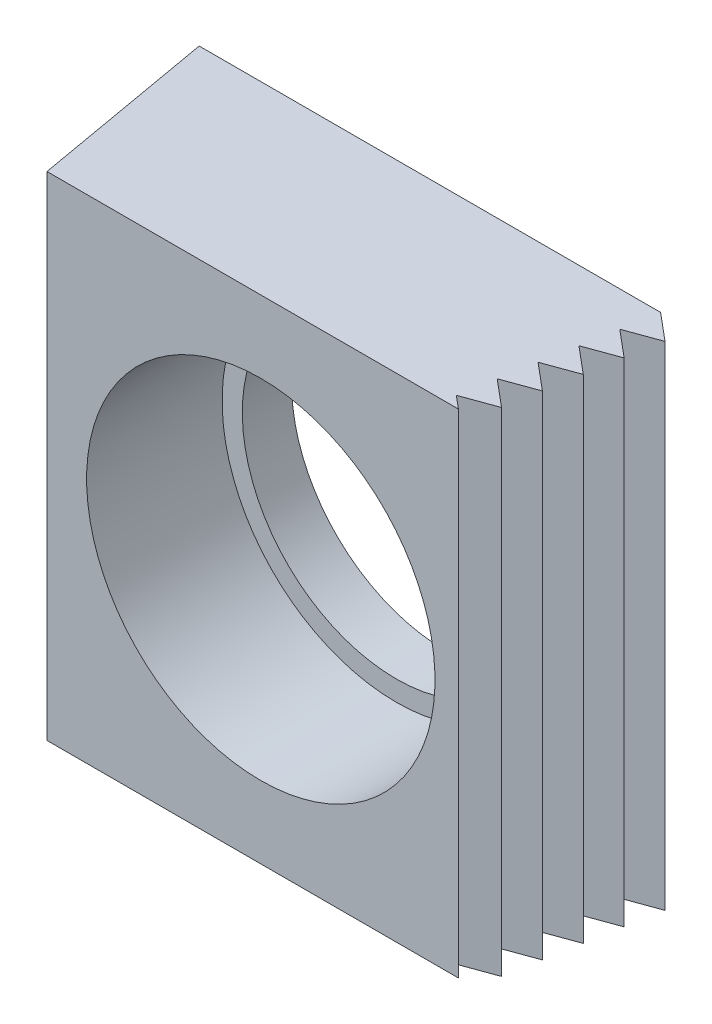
ISO-10303-21;
HEADER;
FILE_DESCRIPTION(('STEP AP214'),'2;1');
FILE_NAME('part.step','',(''),(''),'','','');
FILE_SCHEMA(('AUTOMOTIVE_DESIGN { 1 0 10303 214 1 1 1 1 }'));
ENDSEC;
DATA;
#1=APPLICATION_CONTEXT('core data for automotive mechanical design processes');
#2=APPLICATION_PROTOCOL_DEFINITION('international standard','automotive_design',2000,#1);
#3=PRODUCT_CONTEXT('',#1,'mechanical');
#4=PRODUCT('Part','Part','',(#3));
#5=PRODUCT_RELATED_PRODUCT_CATEGORY('part','',(#4));
#6=PRODUCT_DEFINITION_FORMATION('','',#4);
#7=PRODUCT_DEFINITION_CONTEXT('part definition',#1,'design');
#8=PRODUCT_DEFINITION('design','',#6,#7);
#9=PRODUCT_DEFINITION_SHAPE('','',#8);
#10=(LENGTH_UNIT() NAMED_UNIT(*) SI_UNIT(.MILLI.,.METRE.));
#11=(NAMED_UNIT(*) PLANE_ANGLE_UNIT() SI_UNIT($,.RADIAN.));
#12=(NAMED_UNIT(*) SI_UNIT($,.STERADIAN.) SOLID_ANGLE_UNIT());
#13=UNCERTAINTY_MEASURE_WITH_UNIT(LENGTH_MEASURE(1.E-05),#10,'distance_accuracy_value','');
#14=(GEOMETRIC_REPRESENTATION_CONTEXT(3) GLOBAL_UNCERTAINTY_ASSIGNED_CONTEXT((#13)) GLOBAL_UNIT_ASSIGNED_CONTEXT((#10,
#11,#12)) REPRESENTATION_CONTEXT('',''));
#15=CARTESIAN_POINT('',(0.,0.,0.));
#16=DIRECTION('',(0.,0.,1.));
#17=DIRECTION('',(1.,0.,0.));
#18=AXIS2_PLACEMENT_3D('',#15,#16,#17);
#19=CARTESIAN_POINT('',(12.7,-12.7,9.525));
#20=DIRECTION('',(0.,0.,1.));
#21=DIRECTION('',(0.,1.,0.));
#22=AXIS2_PLACEMENT_3D('',#19,#20,#21);
#23=PLANE('',#22);
#24=CARTESIAN_POINT('',(0.,0.,9.525));
#25=DIRECTION('',(0.,0.,1.));
#26=DIRECTION('',(0.,1.,0.));
#27=AXIS2_PLACEMENT_3D('',#24,#25,#26);
#28=CIRCLE('',#27,8.9789);
#29=CARTESIAN_POINT('',(0.,8.9789,9.525));
#30=VERTEX_POINT('',#29);
#31=EDGE_CURVE('E18',#30,#30,#28,.F.);
#32=ORIENTED_EDGE('',*,*,#31,.T.);
#33=EDGE_LOOP('',(#32));
#34=FACE_BOUND('',#33,.T.);
#35=DIRECTION('',(1.,0.,0.));
#36=VECTOR('',#35,1.);
#37=CARTESIAN_POINT('',(-12.7,-12.7,9.525));
#38=LINE('',#37,#36);
#39=CARTESIAN_POINT('',(-11.0204855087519,-12.7,9.525));
#40=VERTEX_POINT('',#39);
#41=CARTESIAN_POINT('',(10.1861075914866,-12.7,9.525));
#42=VERTEX_POINT('',#41);
#43=EDGE_CURVE('E23',#40,#42,#38,.T.);
#44=ORIENTED_EDGE('',*,*,#43,.T.);
#45=DIRECTION('',(0.,1.,0.));
#46=VECTOR('',#45,1.);
#47=CARTESIAN_POINT('',(10.1861075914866,-12.7,9.525));
#48=LINE('',#47,#46);
#49=CARTESIAN_POINT('',(10.1861075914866,12.7,9.525));
#50=VERTEX_POINT('',#49);
#51=EDGE_CURVE('E216',#42,#50,#48,.T.);
#52=ORIENTED_EDGE('',*,*,#51,.T.);
#53=DIRECTION('',(-1.,0.,0.));
#54=VECTOR('',#53,1.);
#55=CARTESIAN_POINT('',(-12.7,12.7,9.525));
#56=LINE('',#55,#54);
#57=CARTESIAN_POINT('',(-11.0204855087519,12.7,9.525));
#58=VERTEX_POINT('',#57);
#59=EDGE_CURVE('E9',#50,#58,#56,.T.);
#60=ORIENTED_EDGE('',*,*,#59,.T.);
#61=DIRECTION('',(0.,-1.,0.));
#62=VECTOR('',#61,1.);
#63=CARTESIAN_POINT('',(-11.0204855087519,-12.7,9.525));
#64=LINE('',#63,#62);
#65=EDGE_CURVE('E197',#58,#40,#64,.T.);
#66=ORIENTED_EDGE('',*,*,#65,.T.);
#67=EDGE_LOOP('',(#44,#52,#60,#66));
#68=FACE_BOUND('',#67,.T.);
#69=ADVANCED_FACE('F14',(#34,#68),#23,.T.);
#70=CARTESIAN_POINT('',(12.7,-12.7,0.));
#71=DIRECTION('',(0.,0.,1.));
#72=DIRECTION('',(0.,1.,0.));
#73=AXIS2_PLACEMENT_3D('',#70,#71,#72);
#74=PLANE('',#73);
#75=CARTESIAN_POINT('',(0.,0.,0.));
#76=DIRECTION('',(0.,0.,1.));
#77=DIRECTION('',(0.,1.,0.));
#78=AXIS2_PLACEMENT_3D('',#75,#76,#77);
#79=CIRCLE('',#78,7.9375);
#80=CARTESIAN_POINT('',(0.,7.9375,0.));
#81=VERTEX_POINT('',#80);
#82=EDGE_CURVE('E225',#81,#81,#79,.F.);
#83=ORIENTED_EDGE('',*,*,#82,.F.);
#84=EDGE_LOOP('',(#83));
#85=FACE_BOUND('',#84,.T.);
#86=DIRECTION('',(0.,1.,0.));
#87=VECTOR('',#86,1.);
#88=CARTESIAN_POINT('',(11.0844240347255,-12.7,0.));
#89=LINE('',#88,#87);
#90=CARTESIAN_POINT('',(11.0844240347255,-12.7,0.));
#91=VERTEX_POINT('',#90);
#92=CARTESIAN_POINT('',(11.0844240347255,12.7,0.));
#93=VERTEX_POINT('',#92);
#94=EDGE_CURVE('E195',#91,#93,#89,.T.);
#95=ORIENTED_EDGE('',*,*,#94,.F.);
#96=DIRECTION('',(1.,0.,0.));
#97=VECTOR('',#96,1.);
#98=CARTESIAN_POINT('',(-12.7,-12.7,0.));
#99=LINE('',#98,#97);
#100=CARTESIAN_POINT('',(-12.7,-12.7,0.));
#101=VERTEX_POINT('',#100);
#102=EDGE_CURVE('E226',#101,#91,#99,.T.);
#103=ORIENTED_EDGE('',*,*,#102,.F.);
#104=DIRECTION('',(0.,-1.,0.));
#105=VECTOR('',#104,1.);
#106=CARTESIAN_POINT('',(-12.7,-12.7,0.));
#107=LINE('',#106,#105);
#108=CARTESIAN_POINT('',(-12.7,12.7,0.));
#109=VERTEX_POINT('',#108);
#110=EDGE_CURVE('E231',#109,#101,#107,.T.);
#111=ORIENTED_EDGE('',*,*,#110,.F.);
#112=DIRECTION('',(-1.,0.,0.));
#113=VECTOR('',#112,1.);
#114=CARTESIAN_POINT('',(-12.7,12.7,0.));
#115=LINE('',#114,#113);
#116=EDGE_CURVE('E229',#93,#109,#115,.T.);
#117=ORIENTED_EDGE('',*,*,#116,.F.);
#118=EDGE_LOOP('',(#95,#103,#111,#117));
#119=FACE_BOUND('',#118,.T.);
#120=ADVANCED_FACE('F263',(#85,#119),#74,.F.);
#121=CARTESIAN_POINT('',(-12.7,-12.7,9.525));
#122=DIRECTION('',(0.,1.,0.));
#123=DIRECTION('',(-1.,0.,0.));
#124=AXIS2_PLACEMENT_3D('',#121,#122,#123);
#125=PLANE('',#124);
#126=DIRECTION('',(-0.766044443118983,0.,-0.642787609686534));
#127=VECTOR('',#126,1.);
#128=CARTESIAN_POINT('',(12.4917742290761,-12.7,1.18090702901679));
#129=LINE('',#128,#127);
#130=CARTESIAN_POINT('',(12.4917742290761,-12.7,1.18090702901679));
#131=VERTEX_POINT('',#130);
#132=EDGE_CURVE('E193',#131,#91,#129,.T.);
#133=ORIENTED_EDGE('',*,*,#132,.F.);
#134=DIRECTION('',(0.939692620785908,0.,-0.34202014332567));
#135=VECTOR('',#134,1.);
#136=CARTESIAN_POINT('',(10.7830161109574,-12.7,1.80284412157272));
#137=LINE('',#136,#135);
#138=CARTESIAN_POINT('',(10.7830161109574,-12.7,1.80284412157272));
#139=VERTEX_POINT('',#138);
#140=EDGE_CURVE('E190',#139,#131,#137,.T.);
#141=ORIENTED_EDGE('',*,*,#140,.F.);
#142=DIRECTION('',(-0.766044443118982,0.,-0.642787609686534));
#143=VECTOR('',#142,1.);
#144=CARTESIAN_POINT('',(12.176008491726,-12.7,2.9717035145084));
#145=LINE('',#144,#143);
#146=CARTESIAN_POINT('',(12.176008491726,-12.7,2.9717035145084));
#147=VERTEX_POINT('',#146);
#148=EDGE_CURVE('E187',#147,#139,#145,.T.);
#149=ORIENTED_EDGE('',*,*,#148,.F.);
#150=DIRECTION('',(0.939692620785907,0.,-0.342020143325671));
#151=VECTOR('',#150,1.);
#152=CARTESIAN_POINT('',(10.4672503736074,-12.7,3.59364060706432));
#153=LINE('',#152,#151);
#154=CARTESIAN_POINT('',(10.4672503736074,-12.7,3.59364060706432));
#155=VERTEX_POINT('',#154);
#156=EDGE_CURVE('E184',#155,#147,#153,.T.);
#157=ORIENTED_EDGE('',*,*,#156,.F.);
#158=DIRECTION('',(-0.766044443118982,0.,-0.642787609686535));
#159=VECTOR('',#158,1.);
#160=CARTESIAN_POINT('',(11.860242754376,-12.7,4.7625));
#161=LINE('',#160,#159);
#162=CARTESIAN_POINT('',(11.860242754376,-12.7,4.7625));
#163=VERTEX_POINT('',#162);
#164=EDGE_CURVE('E181',#163,#155,#161,.T.);
#165=ORIENTED_EDGE('',*,*,#164,.F.);
#166=DIRECTION('',(0.939692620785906,0.,-0.342020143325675));
#167=VECTOR('',#166,1.);
#168=CARTESIAN_POINT('',(11.860242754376,-12.7,4.7625));
#169=LINE('',#168,#167);
#170=CARTESIAN_POINT('',(10.1514846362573,-12.7,5.38443709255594));
#171=VERTEX_POINT('',#170);
#172=EDGE_CURVE('E178',#171,#163,#169,.T.);
#173=ORIENTED_EDGE('',*,*,#172,.F.);
#174=DIRECTION('',(-0.766044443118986,0.,-0.64278760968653));
#175=VECTOR('',#174,1.);
#176=CARTESIAN_POINT('',(10.1514846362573,-12.7,5.38443709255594));
#177=LINE('',#176,#175);
#178=CARTESIAN_POINT('',(11.5444770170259,-12.7,6.5532964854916));
#179=VERTEX_POINT('',#178);
#180=EDGE_CURVE('E175',#179,#171,#177,.T.);
#181=ORIENTED_EDGE('',*,*,#180,.F.);
#182=DIRECTION('',(0.939692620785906,0.,-0.342020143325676));
#183=VECTOR('',#182,1.);
#184=CARTESIAN_POINT('',(11.5444770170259,-12.7,6.5532964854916));
#185=LINE('',#184,#183);
#186=CARTESIAN_POINT('',(9.83571889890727,-12.7,7.17523357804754));
#187=VERTEX_POINT('',#186);
#188=EDGE_CURVE('E172',#187,#179,#185,.T.);
#189=ORIENTED_EDGE('',*,*,#188,.F.);
#190=DIRECTION('',(-0.766044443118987,0.,-0.642787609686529));
#191=VECTOR('',#190,1.);
#192=CARTESIAN_POINT('',(9.83571889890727,-12.7,7.17523357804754));
#193=LINE('',#192,#191);
#194=CARTESIAN_POINT('',(11.2287112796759,-12.7,8.3440929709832));
#195=VERTEX_POINT('',#194);
#196=EDGE_CURVE('E170',#195,#187,#193,.T.);
#197=ORIENTED_EDGE('',*,*,#196,.F.);
#198=DIRECTION('',(0.939692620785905,0.,-0.342020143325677));
#199=VECTOR('',#198,1.);
#200=CARTESIAN_POINT('',(11.2287112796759,-12.7,8.3440929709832));
#201=LINE('',#200,#199);
#202=CARTESIAN_POINT('',(9.51995316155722,-12.7,8.96603006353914));
#203=VERTEX_POINT('',#202);
#204=EDGE_CURVE('E120',#203,#195,#201,.T.);
#205=ORIENTED_EDGE('',*,*,#204,.F.);
#206=DIRECTION('',(-0.766044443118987,0.,-0.642787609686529));
#207=VECTOR('',#206,1.);
#208=CARTESIAN_POINT('',(9.51995316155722,-12.7,8.96603006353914));
#209=LINE('',#208,#207);
#210=EDGE_CURVE('E167',#42,#203,#209,.T.);
#211=ORIENTED_EDGE('',*,*,#210,.F.);
#212=ORIENTED_EDGE('',*,*,#43,.F.);
#213=DIRECTION('',(0.173648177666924,0.,0.984807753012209));
#214=VECTOR('',#213,1.);
#215=CARTESIAN_POINT('',(-12.7,-12.7,0.));
#216=LINE('',#215,#214);
#217=EDGE_CURVE('E165',#101,#40,#216,.T.);
#218=ORIENTED_EDGE('',*,*,#217,.F.);
#219=ORIENTED_EDGE('',*,*,#102,.T.);
#220=EDGE_LOOP('',(#133,#141,#149,#157,#165,#173,#181,#189,#197,#205,#211,#212,#218,#219));
#221=FACE_BOUND('',#220,.T.);
#222=ADVANCED_FACE('F16',(#221),#125,.F.);
#223=CARTESIAN_POINT('',(-12.7,12.7,9.525));
#224=DIRECTION('',(0.,-1.,0.));
#225=DIRECTION('',(1.,0.,0.));
#226=AXIS2_PLACEMENT_3D('',#223,#224,#225);
#227=PLANE('',#226);
#228=DIRECTION('',(-0.766044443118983,0.,-0.642787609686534));
#229=VECTOR('',#228,1.);
#230=CARTESIAN_POINT('',(12.4917742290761,12.7,1.18090702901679));
#231=LINE('',#230,#229);
#232=CARTESIAN_POINT('',(12.4917742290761,12.7,1.18090702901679));
#233=VERTEX_POINT('',#232);
#234=EDGE_CURVE('E163',#233,#93,#231,.T.);
#235=ORIENTED_EDGE('',*,*,#234,.T.);
#236=ORIENTED_EDGE('',*,*,#116,.T.);
#237=DIRECTION('',(0.173648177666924,0.,0.984807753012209));
#238=VECTOR('',#237,1.);
#239=CARTESIAN_POINT('',(-12.7,12.7,0.));
#240=LINE('',#239,#238);
#241=EDGE_CURVE('E39',#109,#58,#240,.T.);
#242=ORIENTED_EDGE('',*,*,#241,.T.);
#243=ORIENTED_EDGE('',*,*,#59,.F.);
#244=DIRECTION('',(-0.766044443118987,0.,-0.642787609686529));
#245=VECTOR('',#244,1.);
#246=CARTESIAN_POINT('',(9.51995316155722,12.7,8.96603006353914));
#247=LINE('',#246,#245);
#248=CARTESIAN_POINT('',(9.51995316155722,12.7,8.96603006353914));
#249=VERTEX_POINT('',#248);
#250=EDGE_CURVE('E139',#50,#249,#247,.T.);
#251=ORIENTED_EDGE('',*,*,#250,.T.);
#252=DIRECTION('',(0.939692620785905,0.,-0.342020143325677));
#253=VECTOR('',#252,1.);
#254=CARTESIAN_POINT('',(11.2287112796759,12.7,8.3440929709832));
#255=LINE('',#254,#253);
#256=CARTESIAN_POINT('',(11.2287112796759,12.7,8.3440929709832));
#257=VERTEX_POINT('',#256);
#258=EDGE_CURVE('E31',#249,#257,#255,.T.);
#259=ORIENTED_EDGE('',*,*,#258,.T.);
#260=DIRECTION('',(-0.766044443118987,0.,-0.642787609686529));
#261=VECTOR('',#260,1.);
#262=CARTESIAN_POINT('',(9.83571889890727,12.7,7.17523357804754));
#263=LINE('',#262,#261);
#264=CARTESIAN_POINT('',(9.83571889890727,12.7,7.17523357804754));
#265=VERTEX_POINT('',#264);
#266=EDGE_CURVE('E128',#257,#265,#263,.T.);
#267=ORIENTED_EDGE('',*,*,#266,.T.);
#268=DIRECTION('',(0.939692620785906,0.,-0.342020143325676));
#269=VECTOR('',#268,1.);
#270=CARTESIAN_POINT('',(11.5444770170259,12.7,6.5532964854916));
#271=LINE('',#270,#269);
#272=CARTESIAN_POINT('',(11.5444770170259,12.7,6.5532964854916));
#273=VERTEX_POINT('',#272);
#274=EDGE_CURVE('E133',#265,#273,#271,.T.);
#275=ORIENTED_EDGE('',*,*,#274,.T.);
#276=DIRECTION('',(-0.766044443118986,0.,-0.64278760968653));
#277=VECTOR('',#276,1.);
#278=CARTESIAN_POINT('',(10.1514846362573,12.7,5.38443709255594));
#279=LINE('',#278,#277);
#280=CARTESIAN_POINT('',(10.1514846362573,12.7,5.38443709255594));
#281=VERTEX_POINT('',#280);
#282=EDGE_CURVE('E145',#273,#281,#279,.T.);
#283=ORIENTED_EDGE('',*,*,#282,.T.);
#284=DIRECTION('',(0.939692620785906,0.,-0.342020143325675));
#285=VECTOR('',#284,1.);
#286=CARTESIAN_POINT('',(11.860242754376,12.7,4.7625));
#287=LINE('',#286,#285);
#288=CARTESIAN_POINT('',(11.860242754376,12.7,4.7625));
#289=VERTEX_POINT('',#288);
#290=EDGE_CURVE('E148',#281,#289,#287,.T.);
#291=ORIENTED_EDGE('',*,*,#290,.T.);
#292=DIRECTION('',(-0.766044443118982,0.,-0.642787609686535));
#293=VECTOR('',#292,1.);
#294=CARTESIAN_POINT('',(11.860242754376,12.7,4.7625));
#295=LINE('',#294,#293);
#296=CARTESIAN_POINT('',(10.4672503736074,12.7,3.59364060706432));
#297=VERTEX_POINT('',#296);
#298=EDGE_CURVE('E151',#289,#297,#295,.T.);
#299=ORIENTED_EDGE('',*,*,#298,.T.);
#300=DIRECTION('',(0.939692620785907,0.,-0.342020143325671));
#301=VECTOR('',#300,1.);
#302=CARTESIAN_POINT('',(10.4672503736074,12.7,3.59364060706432));
#303=LINE('',#302,#301);
#304=CARTESIAN_POINT('',(12.176008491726,12.7,2.9717035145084));
#305=VERTEX_POINT('',#304);
#306=EDGE_CURVE('E154',#297,#305,#303,.T.);
#307=ORIENTED_EDGE('',*,*,#306,.T.);
#308=DIRECTION('',(-0.766044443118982,0.,-0.642787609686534));
#309=VECTOR('',#308,1.);
#310=CARTESIAN_POINT('',(12.176008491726,12.7,2.9717035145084));
#311=LINE('',#310,#309);
#312=CARTESIAN_POINT('',(10.7830161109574,12.7,1.80284412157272));
#313=VERTEX_POINT('',#312);
#314=EDGE_CURVE('E157',#305,#313,#311,.T.);
#315=ORIENTED_EDGE('',*,*,#314,.T.);
#316=DIRECTION('',(0.939692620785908,0.,-0.34202014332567));
#317=VECTOR('',#316,1.);
#318=CARTESIAN_POINT('',(10.7830161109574,12.7,1.80284412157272));
#319=LINE('',#318,#317);
#320=EDGE_CURVE('E160',#313,#233,#319,.T.);
#321=ORIENTED_EDGE('',*,*,#320,.T.);
#322=EDGE_LOOP('',(#235,#236,#242,#243,#251,#259,#267,#275,#283,#291,#299,#307,#315,#321));
#323=FACE_BOUND('',#322,.T.);
#324=ADVANCED_FACE('F137',(#323),#227,.F.);
#325=CARTESIAN_POINT('',(0.,0.,-1.87571679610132));
#326=DIRECTION('',(0.,0.,-1.));
#327=DIRECTION('',(0.,-1.,0.));
#328=AXIS2_PLACEMENT_3D('',#325,#326,#327);
#329=CYLINDRICAL_SURFACE('',#328,7.9375);
#330=CARTESIAN_POINT('',(0.,0.,2.54));
#331=DIRECTION('',(0.,0.,-1.));
#332=DIRECTION('',(0.,-1.,0.));
#333=AXIS2_PLACEMENT_3D('',#330,#331,#332);
#334=CIRCLE('',#333,7.9375);
#335=CARTESIAN_POINT('',(0.,-7.9375,2.54));
#336=VERTEX_POINT('',#335);
#337=EDGE_CURVE('E222',#336,#336,#334,.T.);
#338=ORIENTED_EDGE('',*,*,#337,.F.);
#339=EDGE_LOOP('',(#338));
#340=FACE_BOUND('',#339,.T.);
#341=ORIENTED_EDGE('',*,*,#82,.T.);
#342=EDGE_LOOP('',(#341));
#343=FACE_BOUND('',#342,.T.);
#344=ADVANCED_FACE('F246',(#340,#343),#329,.F.);
#345=CARTESIAN_POINT('',(0.,0.,-1.87571679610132));
#346=DIRECTION('',(0.,0.,-1.));
#347=DIRECTION('',(0.,-1.,0.));
#348=AXIS2_PLACEMENT_3D('',#345,#346,#347);
#349=CYLINDRICAL_SURFACE('',#348,8.9789);
#350=ORIENTED_EDGE('',*,*,#31,.F.);
#351=EDGE_LOOP('',(#350));
#352=FACE_BOUND('',#351,.T.);
#353=CARTESIAN_POINT('',(0.,0.,2.54));
#354=DIRECTION('',(0.,0.,-1.));
#355=DIRECTION('',(0.,-1.,0.));
#356=AXIS2_PLACEMENT_3D('',#353,#354,#355);
#357=CIRCLE('',#356,8.9789);
#358=CARTESIAN_POINT('',(0.,-8.9789,2.54));
#359=VERTEX_POINT('',#358);
#360=EDGE_CURVE('E219',#359,#359,#357,.T.);
#361=ORIENTED_EDGE('',*,*,#360,.T.);
#362=EDGE_LOOP('',(#361));
#363=FACE_BOUND('',#362,.T.);
#364=ADVANCED_FACE('F242',(#352,#363),#349,.F.);
#365=CARTESIAN_POINT('',(0.,8.9789,2.54));
#366=DIRECTION('',(0.,0.,1.));
#367=DIRECTION('',(0.,1.,0.));
#368=AXIS2_PLACEMENT_3D('',#365,#366,#367);
#369=PLANE('',#368);
#370=ORIENTED_EDGE('',*,*,#337,.T.);
#371=EDGE_LOOP('',(#370));
#372=FACE_BOUND('',#371,.T.);
#373=ORIENTED_EDGE('',*,*,#360,.F.);
#374=EDGE_LOOP('',(#373));
#375=FACE_BOUND('',#374,.T.);
#376=ADVANCED_FACE('F245',(#372,#375),#369,.T.);
#377=CARTESIAN_POINT('',(-12.7,-12.7,0.));
#378=DIRECTION('',(-0.984807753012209,0.,0.173648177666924));
#379=DIRECTION('',(0.173648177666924,0.,0.984807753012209));
#380=AXIS2_PLACEMENT_3D('',#377,#378,#379);
#381=PLANE('',#380);
#382=ORIENTED_EDGE('',*,*,#241,.F.);
#383=ORIENTED_EDGE('',*,*,#110,.T.);
#384=ORIENTED_EDGE('',*,*,#217,.T.);
#385=ORIENTED_EDGE('',*,*,#65,.F.);
#386=EDGE_LOOP('',(#382,#383,#384,#385));
#387=FACE_BOUND('',#386,.T.);
#388=ADVANCED_FACE('F251',(#387),#381,.T.);
#389=CARTESIAN_POINT('',(12.4917742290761,-12.7,1.18090702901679));
#390=DIRECTION('',(0.642787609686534,0.,-0.766044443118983));
#391=DIRECTION('',(-0.766044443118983,0.,-0.642787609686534));
#392=AXIS2_PLACEMENT_3D('',#389,#390,#391);
#393=PLANE('',#392);
#394=ORIENTED_EDGE('',*,*,#234,.F.);
#395=DIRECTION('',(0.,1.,0.));
#396=VECTOR('',#395,1.);
#397=CARTESIAN_POINT('',(12.4917742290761,-12.7,1.18090702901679));
#398=LINE('',#397,#396);
#399=EDGE_CURVE('E198',#131,#233,#398,.T.);
#400=ORIENTED_EDGE('',*,*,#399,.F.);
#401=ORIENTED_EDGE('',*,*,#132,.T.);
#402=ORIENTED_EDGE('',*,*,#94,.T.);
#403=EDGE_LOOP('',(#394,#400,#401,#402));
#404=FACE_BOUND('',#403,.T.);
#405=ADVANCED_FACE('F259',(#404),#393,.T.);
#406=CARTESIAN_POINT('',(10.7830161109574,-12.7,1.80284412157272));
#407=DIRECTION('',(0.34202014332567,0.,0.939692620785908));
#408=DIRECTION('',(0.939692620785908,0.,-0.34202014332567));
#409=AXIS2_PLACEMENT_3D('',#406,#407,#408);
#410=PLANE('',#409);
#411=ORIENTED_EDGE('',*,*,#320,.F.);
#412=DIRECTION('',(0.,1.,0.));
#413=VECTOR('',#412,1.);
#414=CARTESIAN_POINT('',(10.7830161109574,-12.7,1.80284412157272));
#415=LINE('',#414,#413);
#416=EDGE_CURVE('E200',#139,#313,#415,.T.);
#417=ORIENTED_EDGE('',*,*,#416,.F.);
#418=ORIENTED_EDGE('',*,*,#140,.T.);
#419=ORIENTED_EDGE('',*,*,#399,.T.);
#420=EDGE_LOOP('',(#411,#417,#418,#419));
#421=FACE_BOUND('',#420,.T.);
#422=ADVANCED_FACE('F296',(#421),#410,.T.);
#423=CARTESIAN_POINT('',(12.176008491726,-12.7,2.9717035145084));
#424=DIRECTION('',(0.642787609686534,0.,-0.766044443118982));
#425=DIRECTION('',(-0.766044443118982,0.,-0.642787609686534));
#426=AXIS2_PLACEMENT_3D('',#423,#424,#425);
#427=PLANE('',#426);
#428=ORIENTED_EDGE('',*,*,#314,.F.);
#429=DIRECTION('',(0.,1.,0.));
#430=VECTOR('',#429,1.);
#431=CARTESIAN_POINT('',(12.176008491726,-12.7,2.9717035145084));
#432=LINE('',#431,#430);
#433=EDGE_CURVE('E202',#147,#305,#432,.T.);
#434=ORIENTED_EDGE('',*,*,#433,.F.);
#435=ORIENTED_EDGE('',*,*,#148,.T.);
#436=ORIENTED_EDGE('',*,*,#416,.T.);
#437=EDGE_LOOP('',(#428,#434,#435,#436));
#438=FACE_BOUND('',#437,.T.);
#439=ADVANCED_FACE('F298',(#438),#427,.T.);
#440=CARTESIAN_POINT('',(10.4672503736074,-12.7,3.59364060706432));
#441=DIRECTION('',(0.342020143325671,0.,0.939692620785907));
#442=DIRECTION('',(0.939692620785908,0.,-0.342020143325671));
#443=AXIS2_PLACEMENT_3D('',#440,#441,#442);
#444=PLANE('',#443);
#445=ORIENTED_EDGE('',*,*,#306,.F.);
#446=DIRECTION('',(0.,1.,0.));
#447=VECTOR('',#446,1.);
#448=CARTESIAN_POINT('',(10.4672503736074,-12.7,3.59364060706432));
#449=LINE('',#448,#447);
#450=EDGE_CURVE('E204',#155,#297,#449,.T.);
#451=ORIENTED_EDGE('',*,*,#450,.F.);
#452=ORIENTED_EDGE('',*,*,#156,.T.);
#453=ORIENTED_EDGE('',*,*,#433,.T.);
#454=EDGE_LOOP('',(#445,#451,#452,#453));
#455=FACE_BOUND('',#454,.T.);
#456=ADVANCED_FACE('F304',(#455),#444,.T.);
#457=CARTESIAN_POINT('',(11.860242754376,-12.7,4.7625));
#458=DIRECTION('',(0.642787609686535,0.,-0.766044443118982));
#459=DIRECTION('',(-0.766044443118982,0.,-0.642787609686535));
#460=AXIS2_PLACEMENT_3D('',#457,#458,#459);
#461=PLANE('',#460);
#462=ORIENTED_EDGE('',*,*,#298,.F.);
#463=DIRECTION('',(0.,1.,0.));
#464=VECTOR('',#463,1.);
#465=CARTESIAN_POINT('',(11.860242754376,-12.7,4.7625));
#466=LINE('',#465,#464);
#467=EDGE_CURVE('E206',#163,#289,#466,.T.);
#468=ORIENTED_EDGE('',*,*,#467,.F.);
#469=ORIENTED_EDGE('',*,*,#164,.T.);
#470=ORIENTED_EDGE('',*,*,#450,.T.);
#471=EDGE_LOOP('',(#462,#468,#469,#470));
#472=FACE_BOUND('',#471,.T.);
#473=ADVANCED_FACE('F307',(#472),#461,.T.);
#474=CARTESIAN_POINT('',(11.860242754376,-12.7,4.7625));
#475=DIRECTION('',(0.342020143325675,0.,0.939692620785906));
#476=DIRECTION('',(0.939692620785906,0.,-0.342020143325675));
#477=AXIS2_PLACEMENT_3D('',#474,#475,#476);
#478=PLANE('',#477);
#479=ORIENTED_EDGE('',*,*,#290,.F.);
#480=DIRECTION('',(0.,1.,0.));
#481=VECTOR('',#480,1.);
#482=CARTESIAN_POINT('',(10.1514846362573,-12.7,5.38443709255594));
#483=LINE('',#482,#481);
#484=EDGE_CURVE('E208',#171,#281,#483,.T.);
#485=ORIENTED_EDGE('',*,*,#484,.F.);
#486=ORIENTED_EDGE('',*,*,#172,.T.);
#487=ORIENTED_EDGE('',*,*,#467,.T.);
#488=EDGE_LOOP('',(#479,#485,#486,#487));
#489=FACE_BOUND('',#488,.T.);
#490=ADVANCED_FACE('F310',(#489),#478,.T.);
#491=CARTESIAN_POINT('',(10.1514846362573,-12.7,5.38443709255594));
#492=DIRECTION('',(0.64278760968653,0.,-0.766044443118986));
#493=DIRECTION('',(-0.766044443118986,0.,-0.64278760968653));
#494=AXIS2_PLACEMENT_3D('',#491,#492,#493);
#495=PLANE('',#494);
#496=ORIENTED_EDGE('',*,*,#282,.F.);
#497=DIRECTION('',(0.,1.,0.));
#498=VECTOR('',#497,1.);
#499=CARTESIAN_POINT('',(11.5444770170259,-12.7,6.5532964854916));
#500=LINE('',#499,#498);
#501=EDGE_CURVE('E210',#179,#273,#500,.T.);
#502=ORIENTED_EDGE('',*,*,#501,.F.);
#503=ORIENTED_EDGE('',*,*,#180,.T.);
#504=ORIENTED_EDGE('',*,*,#484,.T.);
#505=EDGE_LOOP('',(#496,#502,#503,#504));
#506=FACE_BOUND('',#505,.T.);
#507=ADVANCED_FACE('F315',(#506),#495,.T.);
#508=CARTESIAN_POINT('',(11.5444770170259,-12.7,6.5532964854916));
#509=DIRECTION('',(0.342020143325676,0.,0.939692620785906));
#510=DIRECTION('',(0.939692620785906,0.,-0.342020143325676));
#511=AXIS2_PLACEMENT_3D('',#508,#509,#510);
#512=PLANE('',#511);
#513=ORIENTED_EDGE('',*,*,#274,.F.);
#514=DIRECTION('',(0.,1.,0.));
#515=VECTOR('',#514,1.);
#516=CARTESIAN_POINT('',(9.83571889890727,-12.7,7.17523357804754));
#517=LINE('',#516,#515);
#518=EDGE_CURVE('E124',#187,#265,#517,.T.);
#519=ORIENTED_EDGE('',*,*,#518,.F.);
#520=ORIENTED_EDGE('',*,*,#188,.T.);
#521=ORIENTED_EDGE('',*,*,#501,.T.);
#522=EDGE_LOOP('',(#513,#519,#520,#521));
#523=FACE_BOUND('',#522,.T.);
#524=ADVANCED_FACE('F317',(#523),#512,.T.);
#525=CARTESIAN_POINT('',(9.83571889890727,-12.7,7.17523357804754));
#526=DIRECTION('',(0.642787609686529,0.,-0.766044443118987));
#527=DIRECTION('',(-0.766044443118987,0.,-0.642787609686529));
#528=AXIS2_PLACEMENT_3D('',#525,#526,#527);
#529=PLANE('',#528);
#530=ORIENTED_EDGE('',*,*,#266,.F.);
#531=DIRECTION('',(0.,1.,0.));
#532=VECTOR('',#531,1.);
#533=CARTESIAN_POINT('',(11.2287112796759,-12.7,8.3440929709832));
#534=LINE('',#533,#532);
#535=EDGE_CURVE('E116',#195,#257,#534,.T.);
#536=ORIENTED_EDGE('',*,*,#535,.F.);
#537=ORIENTED_EDGE('',*,*,#196,.T.);
#538=ORIENTED_EDGE('',*,*,#518,.T.);
#539=EDGE_LOOP('',(#530,#536,#537,#538));
#540=FACE_BOUND('',#539,.T.);
#541=ADVANCED_FACE('F129',(#540),#529,.T.);
#542=CARTESIAN_POINT('',(11.2287112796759,-12.7,8.3440929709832));
#543=DIRECTION('',(0.342020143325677,0.,0.939692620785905));
#544=DIRECTION('',(0.939692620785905,0.,-0.342020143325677));
#545=AXIS2_PLACEMENT_3D('',#542,#543,#544);
#546=PLANE('',#545);
#547=ORIENTED_EDGE('',*,*,#258,.F.);
#548=DIRECTION('',(0.,1.,0.));
#549=VECTOR('',#548,1.);
#550=CARTESIAN_POINT('',(9.51995316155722,-12.7,8.96603006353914));
#551=LINE('',#550,#549);
#552=EDGE_CURVE('E125',#203,#249,#551,.T.);
#553=ORIENTED_EDGE('',*,*,#552,.F.);
#554=ORIENTED_EDGE('',*,*,#204,.T.);
#555=ORIENTED_EDGE('',*,*,#535,.T.);
#556=EDGE_LOOP('',(#547,#553,#554,#555));
#557=FACE_BOUND('',#556,.T.);
#558=ADVANCED_FACE('F118',(#557),#546,.T.);
#559=CARTESIAN_POINT('',(9.51995316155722,-12.7,8.96603006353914));
#560=DIRECTION('',(0.642787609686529,0.,-0.766044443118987));
#561=DIRECTION('',(-0.766044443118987,0.,-0.642787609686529));
#562=AXIS2_PLACEMENT_3D('',#559,#560,#561);
#563=PLANE('',#562);
#564=ORIENTED_EDGE('',*,*,#210,.T.);
#565=ORIENTED_EDGE('',*,*,#552,.T.);
#566=ORIENTED_EDGE('',*,*,#250,.F.);
#567=ORIENTED_EDGE('',*,*,#51,.F.);
#568=EDGE_LOOP('',(#564,#565,#566,#567));
#569=FACE_BOUND('',#568,.T.);
#570=ADVANCED_FACE('F321',(#569),#563,.T.);
#571=CLOSED_SHELL('',(#69,#120,#222,#324,#344,#364,#376,#388,#405,#422,#439,#456,#473,#490,#507,
#524,#541,#558,#570));
#572=MANIFOLD_SOLID_BREP('B1',#571);
#573=ADVANCED_BREP_SHAPE_REPRESENTATION('',(#18,#572),#14);
#574=SHAPE_DEFINITION_REPRESENTATION(#9,#573);
ENDSEC;
END-ISO-10303-21;
